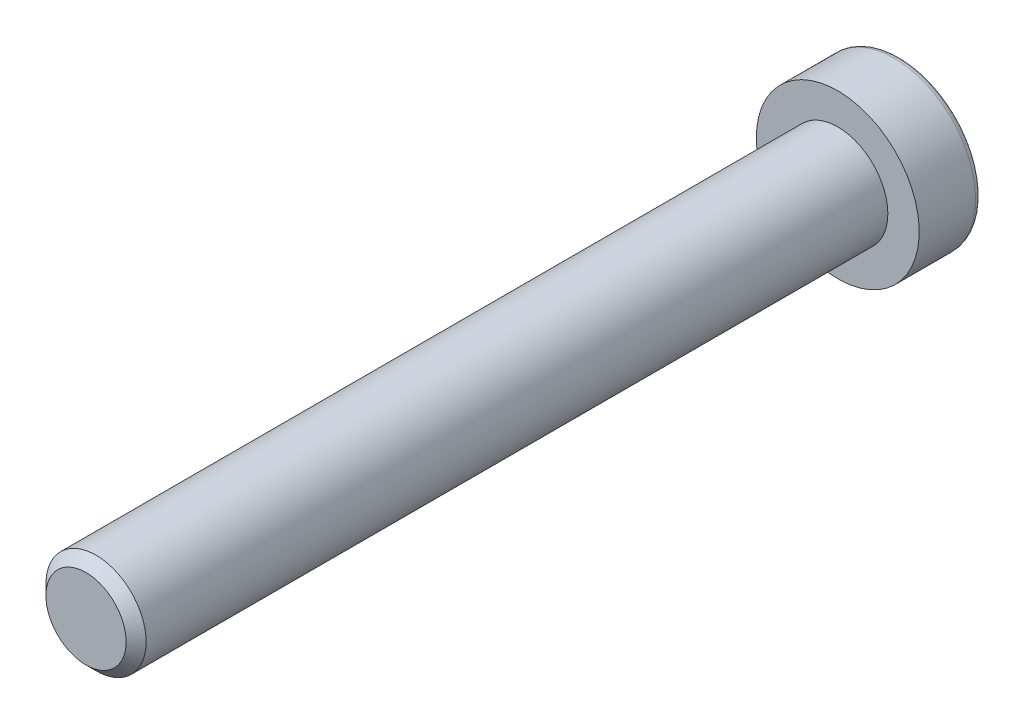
ISO-10303-21;
HEADER;
FILE_DESCRIPTION(('STEP AP214'),'2;1');
FILE_NAME('part.step','',(''),(''),'','','');
FILE_SCHEMA(('AUTOMOTIVE_DESIGN { 1 0 10303 214 1 1 1 1 }'));
ENDSEC;
DATA;
#1=APPLICATION_CONTEXT('core data for automotive mechanical design processes');
#2=APPLICATION_PROTOCOL_DEFINITION('international standard','automotive_design',2000,#1);
#3=PRODUCT_CONTEXT('',#1,'mechanical');
#4=PRODUCT('Part','Part','',(#3));
#5=PRODUCT_RELATED_PRODUCT_CATEGORY('part','',(#4));
#6=PRODUCT_DEFINITION_FORMATION('','',#4);
#7=PRODUCT_DEFINITION_CONTEXT('part definition',#1,'design');
#8=PRODUCT_DEFINITION('design','',#6,#7);
#9=PRODUCT_DEFINITION_SHAPE('','',#8);
#10=(LENGTH_UNIT() NAMED_UNIT(*) SI_UNIT(.MILLI.,.METRE.));
#11=(NAMED_UNIT(*) PLANE_ANGLE_UNIT() SI_UNIT($,.RADIAN.));
#12=(NAMED_UNIT(*) SI_UNIT($,.STERADIAN.) SOLID_ANGLE_UNIT());
#13=UNCERTAINTY_MEASURE_WITH_UNIT(LENGTH_MEASURE(1.E-05),#10,'distance_accuracy_value','');
#14=(GEOMETRIC_REPRESENTATION_CONTEXT(3) GLOBAL_UNCERTAINTY_ASSIGNED_CONTEXT((#13)) GLOBAL_UNIT_ASSIGNED_CONTEXT((#10,
#11,#12)) REPRESENTATION_CONTEXT('',''));
#15=CARTESIAN_POINT('',(0.,0.,0.));
#16=DIRECTION('',(0.,0.,1.));
#17=DIRECTION('',(1.,0.,0.));
#18=AXIS2_PLACEMENT_3D('',#15,#16,#17);
#19=CARTESIAN_POINT('',(0.,0.,-5.));
#20=DIRECTION('',(0.,0.,1.));
#21=DIRECTION('',(1.,0.,0.));
#22=AXIS2_PLACEMENT_3D('',#19,#20,#21);
#23=PLANE('',#22);
#24=CARTESIAN_POINT('',(0.,0.,-5.));
#25=DIRECTION('',(0.,0.,-1.));
#26=DIRECTION('',(-1.,0.,0.));
#27=AXIS2_PLACEMENT_3D('',#24,#25,#26);
#28=CIRCLE('',#27,6.);
#29=CARTESIAN_POINT('',(-6.,0.,-5.));
#30=VERTEX_POINT('',#29);
#31=EDGE_CURVE('E139',#30,#30,#28,.T.);
#32=ORIENTED_EDGE('',*,*,#31,.T.);
#33=EDGE_LOOP('',(#32));
#34=FACE_BOUND('',#33,.T.);
#35=DIRECTION('',(-0.866025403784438,-0.500000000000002,0.));
#36=VECTOR('',#35,1.);
#37=CARTESIAN_POINT('',(0.,3.46410161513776,-5.));
#38=LINE('',#37,#36);
#39=CARTESIAN_POINT('',(0.,3.46410161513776,-5.));
#40=VERTEX_POINT('',#39);
#41=CARTESIAN_POINT('',(-3.,1.73205080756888,-5.));
#42=VERTEX_POINT('',#41);
#43=EDGE_CURVE('E83',#40,#42,#38,.T.);
#44=ORIENTED_EDGE('',*,*,#43,.T.);
#45=DIRECTION('',(0.,-1.,0.));
#46=VECTOR('',#45,1.);
#47=CARTESIAN_POINT('',(-3.,-1.73205080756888,-5.));
#48=LINE('',#47,#46);
#49=CARTESIAN_POINT('',(-3.,-1.73205080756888,-5.));
#50=VERTEX_POINT('',#49);
#51=EDGE_CURVE('E91',#42,#50,#48,.T.);
#52=ORIENTED_EDGE('',*,*,#51,.T.);
#53=DIRECTION('',(0.866025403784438,-0.500000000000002,0.));
#54=VECTOR('',#53,1.);
#55=CARTESIAN_POINT('',(0.,-3.46410161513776,-5.));
#56=LINE('',#55,#54);
#57=CARTESIAN_POINT('',(0.,-3.46410161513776,-5.));
#58=VERTEX_POINT('',#57);
#59=EDGE_CURVE('E109',#50,#58,#56,.T.);
#60=ORIENTED_EDGE('',*,*,#59,.T.);
#61=DIRECTION('',(0.86602540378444,0.499999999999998,0.));
#62=VECTOR('',#61,1.);
#63=CARTESIAN_POINT('',(0.,-3.46410161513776,-5.));
#64=LINE('',#63,#62);
#65=CARTESIAN_POINT('',(3.,-1.73205080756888,-5.));
#66=VERTEX_POINT('',#65);
#67=EDGE_CURVE('E112',#58,#66,#64,.T.);
#68=ORIENTED_EDGE('',*,*,#67,.T.);
#69=DIRECTION('',(0.,1.,0.));
#70=VECTOR('',#69,1.);
#71=CARTESIAN_POINT('',(3.,-1.73205080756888,-5.));
#72=LINE('',#71,#70);
#73=CARTESIAN_POINT('',(3.,1.73205080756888,-5.));
#74=VERTEX_POINT('',#73);
#75=EDGE_CURVE('E102',#66,#74,#72,.T.);
#76=ORIENTED_EDGE('',*,*,#75,.T.);
#77=DIRECTION('',(-0.86602540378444,0.499999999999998,0.));
#78=VECTOR('',#77,1.);
#79=CARTESIAN_POINT('',(0.,3.46410161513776,-5.));
#80=LINE('',#79,#78);
#81=EDGE_CURVE('E43',#74,#40,#80,.T.);
#82=ORIENTED_EDGE('',*,*,#81,.T.);
#83=EDGE_LOOP('',(#44,#52,#60,#68,#76,#82));
#84=FACE_BOUND('',#83,.T.);
#85=ADVANCED_FACE('F29',(#34,#84),#23,.F.);
#86=CARTESIAN_POINT('',(0.,0.,-4.5));
#87=DIRECTION('',(0.,0.,-1.));
#88=DIRECTION('',(-1.,0.,0.));
#89=AXIS2_PLACEMENT_3D('',#86,#87,#88);
#90=TOROIDAL_SURFACE('',#89,6.,0.499999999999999);
#91=ORIENTED_EDGE('',*,*,#31,.F.);
#92=EDGE_LOOP('',(#91));
#93=FACE_BOUND('',#92,.T.);
#94=CARTESIAN_POINT('',(0.,0.,-4.5));
#95=DIRECTION('',(0.,0.,-1.));
#96=DIRECTION('',(-1.,0.,0.));
#97=AXIS2_PLACEMENT_3D('',#94,#95,#96);
#98=CIRCLE('',#97,6.5);
#99=CARTESIAN_POINT('',(-6.5,0.,-4.5));
#100=VERTEX_POINT('',#99);
#101=EDGE_CURVE('E136',#100,#100,#98,.T.);
#102=ORIENTED_EDGE('',*,*,#101,.T.);
#103=EDGE_LOOP('',(#102));
#104=FACE_BOUND('',#103,.T.);
#105=ADVANCED_FACE('F158',(#93,#104),#90,.T.);
#106=CARTESIAN_POINT('',(0.,0.,0.));
#107=DIRECTION('',(0.,0.,-1.));
#108=DIRECTION('',(-1.,0.,0.));
#109=AXIS2_PLACEMENT_3D('',#106,#107,#108);
#110=CYLINDRICAL_SURFACE('',#109,6.5);
#111=ORIENTED_EDGE('',*,*,#101,.F.);
#112=EDGE_LOOP('',(#111));
#113=FACE_BOUND('',#112,.T.);
#114=CARTESIAN_POINT('',(0.,0.,0.));
#115=DIRECTION('',(0.,0.,-1.));
#116=DIRECTION('',(-1.,0.,0.));
#117=AXIS2_PLACEMENT_3D('',#114,#115,#116);
#118=CIRCLE('',#117,6.5);
#119=CARTESIAN_POINT('',(-6.5,0.,0.));
#120=VERTEX_POINT('',#119);
#121=EDGE_CURVE('E97',#120,#120,#118,.T.);
#122=ORIENTED_EDGE('',*,*,#121,.T.);
#123=EDGE_LOOP('',(#122));
#124=FACE_BOUND('',#123,.T.);
#125=ADVANCED_FACE('F163',(#113,#124),#110,.T.);
#126=CARTESIAN_POINT('',(0.,0.,0.));
#127=DIRECTION('',(0.,0.,-1.));
#128=DIRECTION('',(-1.,0.,0.));
#129=AXIS2_PLACEMENT_3D('',#126,#127,#128);
#130=PLANE('',#129);
#131=CARTESIAN_POINT('',(0.,0.,0.));
#132=DIRECTION('',(0.,0.,1.));
#133=DIRECTION('',(1.,0.,0.));
#134=AXIS2_PLACEMENT_3D('',#131,#132,#133);
#135=CIRCLE('',#134,4.);
#136=CARTESIAN_POINT('',(4.,0.,0.));
#137=VERTEX_POINT('',#136);
#138=EDGE_CURVE('E103',#137,#137,#135,.T.);
#139=ORIENTED_EDGE('',*,*,#138,.F.);
#140=EDGE_LOOP('',(#139));
#141=FACE_BOUND('',#140,.T.);
#142=ORIENTED_EDGE('',*,*,#121,.F.);
#143=EDGE_LOOP('',(#142));
#144=FACE_BOUND('',#143,.T.);
#145=ADVANCED_FACE('F171',(#141,#144),#130,.F.);
#146=CARTESIAN_POINT('',(0.,3.46410161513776,-0.999999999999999));
#147=DIRECTION('',(-0.499999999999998,-0.86602540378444,0.));
#148=DIRECTION('',(0.86602540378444,-0.499999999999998,0.));
#149=AXIS2_PLACEMENT_3D('',#146,#147,#148);
#150=PLANE('',#149);
#151=ORIENTED_EDGE('',*,*,#81,.F.);
#152=DIRECTION('',(0.,0.,-1.));
#153=VECTOR('',#152,1.);
#154=CARTESIAN_POINT('',(3.,1.73205080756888,-0.999999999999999));
#155=LINE('',#154,#153);
#156=CARTESIAN_POINT('',(3.,1.73205080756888,-0.999999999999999));
#157=VERTEX_POINT('',#156);
#158=EDGE_CURVE('E125',#157,#74,#155,.T.);
#159=ORIENTED_EDGE('',*,*,#158,.F.);
#160=DIRECTION('',(-0.86602540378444,0.499999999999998,0.));
#161=VECTOR('',#160,1.);
#162=CARTESIAN_POINT('',(0.,3.46410161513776,-0.999999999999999));
#163=LINE('',#162,#161);
#164=CARTESIAN_POINT('',(0.,3.46410161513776,-0.999999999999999));
#165=VERTEX_POINT('',#164);
#166=EDGE_CURVE('E96',#157,#165,#163,.T.);
#167=ORIENTED_EDGE('',*,*,#166,.T.);
#168=DIRECTION('',(0.,0.,-1.));
#169=VECTOR('',#168,1.);
#170=CARTESIAN_POINT('',(0.,3.46410161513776,-0.999999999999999));
#171=LINE('',#170,#169);
#172=EDGE_CURVE('E85',#165,#40,#171,.T.);
#173=ORIENTED_EDGE('',*,*,#172,.T.);
#174=EDGE_LOOP('',(#151,#159,#167,#173));
#175=FACE_BOUND('',#174,.T.);
#176=ADVANCED_FACE('F94',(#175),#150,.T.);
#177=CARTESIAN_POINT('',(0.,3.46410161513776,-0.999999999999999));
#178=DIRECTION('',(0.500000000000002,-0.866025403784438,0.));
#179=DIRECTION('',(0.866025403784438,0.500000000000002,0.));
#180=AXIS2_PLACEMENT_3D('',#177,#178,#179);
#181=PLANE('',#180);
#182=ORIENTED_EDGE('',*,*,#43,.F.);
#183=ORIENTED_EDGE('',*,*,#172,.F.);
#184=DIRECTION('',(-0.866025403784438,-0.500000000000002,0.));
#185=VECTOR('',#184,1.);
#186=CARTESIAN_POINT('',(0.,3.46410161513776,-0.999999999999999));
#187=LINE('',#186,#185);
#188=CARTESIAN_POINT('',(-3.,1.73205080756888,-0.999999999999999));
#189=VERTEX_POINT('',#188);
#190=EDGE_CURVE('E116',#165,#189,#187,.T.);
#191=ORIENTED_EDGE('',*,*,#190,.T.);
#192=DIRECTION('',(0.,0.,-1.));
#193=VECTOR('',#192,1.);
#194=CARTESIAN_POINT('',(-3.,1.73205080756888,-0.999999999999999));
#195=LINE('',#194,#193);
#196=EDGE_CURVE('E87',#189,#42,#195,.T.);
#197=ORIENTED_EDGE('',*,*,#196,.T.);
#198=EDGE_LOOP('',(#182,#183,#191,#197));
#199=FACE_BOUND('',#198,.T.);
#200=ADVANCED_FACE('F84',(#199),#181,.T.);
#201=CARTESIAN_POINT('',(-3.,-1.73205080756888,-0.999999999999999));
#202=DIRECTION('',(1.,0.,0.));
#203=DIRECTION('',(0.,0.,-1.));
#204=AXIS2_PLACEMENT_3D('',#201,#202,#203);
#205=PLANE('',#204);
#206=ORIENTED_EDGE('',*,*,#51,.F.);
#207=ORIENTED_EDGE('',*,*,#196,.F.);
#208=DIRECTION('',(0.,-1.,0.));
#209=VECTOR('',#208,1.);
#210=CARTESIAN_POINT('',(-3.,-1.73205080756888,-0.999999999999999));
#211=LINE('',#210,#209);
#212=CARTESIAN_POINT('',(-3.,-1.73205080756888,-0.999999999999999));
#213=VERTEX_POINT('',#212);
#214=EDGE_CURVE('E118',#189,#213,#211,.T.);
#215=ORIENTED_EDGE('',*,*,#214,.T.);
#216=DIRECTION('',(0.,0.,-1.));
#217=VECTOR('',#216,1.);
#218=CARTESIAN_POINT('',(-3.,-1.73205080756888,-0.999999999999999));
#219=LINE('',#218,#217);
#220=EDGE_CURVE('E131',#213,#50,#219,.T.);
#221=ORIENTED_EDGE('',*,*,#220,.T.);
#222=EDGE_LOOP('',(#206,#207,#215,#221));
#223=FACE_BOUND('',#222,.T.);
#224=ADVANCED_FACE('F186',(#223),#205,.T.);
#225=CARTESIAN_POINT('',(0.,-3.46410161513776,-0.999999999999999));
#226=DIRECTION('',(0.500000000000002,0.866025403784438,0.));
#227=DIRECTION('',(-0.866025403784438,0.500000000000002,0.));
#228=AXIS2_PLACEMENT_3D('',#225,#226,#227);
#229=PLANE('',#228);
#230=ORIENTED_EDGE('',*,*,#59,.F.);
#231=ORIENTED_EDGE('',*,*,#220,.F.);
#232=DIRECTION('',(0.866025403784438,-0.500000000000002,0.));
#233=VECTOR('',#232,1.);
#234=CARTESIAN_POINT('',(0.,-3.46410161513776,-0.999999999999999));
#235=LINE('',#234,#233);
#236=CARTESIAN_POINT('',(0.,-3.46410161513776,-0.999999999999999));
#237=VERTEX_POINT('',#236);
#238=EDGE_CURVE('E120',#213,#237,#235,.T.);
#239=ORIENTED_EDGE('',*,*,#238,.T.);
#240=DIRECTION('',(0.,0.,-1.));
#241=VECTOR('',#240,1.);
#242=CARTESIAN_POINT('',(0.,-3.46410161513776,-0.999999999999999));
#243=LINE('',#242,#241);
#244=EDGE_CURVE('E129',#237,#58,#243,.T.);
#245=ORIENTED_EDGE('',*,*,#244,.T.);
#246=EDGE_LOOP('',(#230,#231,#239,#245));
#247=FACE_BOUND('',#246,.T.);
#248=ADVANCED_FACE('F189',(#247),#229,.T.);
#249=CARTESIAN_POINT('',(0.,-3.46410161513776,-0.999999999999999));
#250=DIRECTION('',(-0.499999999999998,0.86602540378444,0.));
#251=DIRECTION('',(-0.86602540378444,-0.499999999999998,0.));
#252=AXIS2_PLACEMENT_3D('',#249,#250,#251);
#253=PLANE('',#252);
#254=ORIENTED_EDGE('',*,*,#67,.F.);
#255=ORIENTED_EDGE('',*,*,#244,.F.);
#256=DIRECTION('',(0.86602540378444,0.499999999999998,0.));
#257=VECTOR('',#256,1.);
#258=CARTESIAN_POINT('',(0.,-3.46410161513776,-0.999999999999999));
#259=LINE('',#258,#257);
#260=CARTESIAN_POINT('',(3.,-1.73205080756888,-0.999999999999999));
#261=VERTEX_POINT('',#260);
#262=EDGE_CURVE('E122',#237,#261,#259,.T.);
#263=ORIENTED_EDGE('',*,*,#262,.T.);
#264=DIRECTION('',(0.,0.,-1.));
#265=VECTOR('',#264,1.);
#266=CARTESIAN_POINT('',(3.,-1.73205080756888,-0.999999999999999));
#267=LINE('',#266,#265);
#268=EDGE_CURVE('E127',#261,#66,#267,.T.);
#269=ORIENTED_EDGE('',*,*,#268,.T.);
#270=EDGE_LOOP('',(#254,#255,#263,#269));
#271=FACE_BOUND('',#270,.T.);
#272=ADVANCED_FACE('F193',(#271),#253,.T.);
#273=CARTESIAN_POINT('',(3.,-1.73205080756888,-0.999999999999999));
#274=DIRECTION('',(-1.,0.,0.));
#275=DIRECTION('',(0.,-1.,0.));
#276=AXIS2_PLACEMENT_3D('',#273,#274,#275);
#277=PLANE('',#276);
#278=ORIENTED_EDGE('',*,*,#75,.F.);
#279=ORIENTED_EDGE('',*,*,#268,.F.);
#280=DIRECTION('',(0.,1.,0.));
#281=VECTOR('',#280,1.);
#282=CARTESIAN_POINT('',(3.,-1.73205080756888,-0.999999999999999));
#283=LINE('',#282,#281);
#284=EDGE_CURVE('E50',#261,#157,#283,.T.);
#285=ORIENTED_EDGE('',*,*,#284,.T.);
#286=ORIENTED_EDGE('',*,*,#158,.T.);
#287=EDGE_LOOP('',(#278,#279,#285,#286));
#288=FACE_BOUND('',#287,.T.);
#289=ADVANCED_FACE('F197',(#288),#277,.T.);
#290=CARTESIAN_POINT('',(-3.,5.19615242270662,-0.999999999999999));
#291=DIRECTION('',(0.,0.,1.));
#292=DIRECTION('',(1.,0.,0.));
#293=AXIS2_PLACEMENT_3D('',#290,#291,#292);
#294=PLANE('',#293);
#295=ORIENTED_EDGE('',*,*,#166,.F.);
#296=ORIENTED_EDGE('',*,*,#284,.F.);
#297=ORIENTED_EDGE('',*,*,#262,.F.);
#298=ORIENTED_EDGE('',*,*,#238,.F.);
#299=ORIENTED_EDGE('',*,*,#214,.F.);
#300=ORIENTED_EDGE('',*,*,#190,.F.);
#301=EDGE_LOOP('',(#295,#296,#297,#298,#299,#300));
#302=FACE_BOUND('',#301,.T.);
#303=ADVANCED_FACE('F201',(#302),#294,.F.);
#304=CARTESIAN_POINT('',(0.,0.,60.));
#305=DIRECTION('',(0.,0.,1.));
#306=DIRECTION('',(1.,0.,0.));
#307=AXIS2_PLACEMENT_3D('',#304,#305,#306);
#308=PLANE('',#307);
#309=CARTESIAN_POINT('',(0.,0.,60.));
#310=DIRECTION('',(0.,0.,1.));
#311=DIRECTION('',(1.,0.,0.));
#312=AXIS2_PLACEMENT_3D('',#309,#310,#311);
#313=CIRCLE('',#312,3.2);
#314=CARTESIAN_POINT('',(3.20000000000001,0.,60.));
#315=VERTEX_POINT('',#314);
#316=EDGE_CURVE('E36',#315,#315,#313,.T.);
#317=ORIENTED_EDGE('',*,*,#316,.T.);
#318=EDGE_LOOP('',(#317));
#319=FACE_BOUND('',#318,.T.);
#320=ADVANCED_FACE('F144',(#319),#308,.T.);
#321=CARTESIAN_POINT('',(0.,0.,0.));
#322=DIRECTION('',(0.,0.,1.));
#323=DIRECTION('',(1.,0.,0.));
#324=AXIS2_PLACEMENT_3D('',#321,#322,#323);
#325=CYLINDRICAL_SURFACE('',#324,4.);
#326=CARTESIAN_POINT('',(0.,0.,59.2));
#327=DIRECTION('',(0.,0.,1.));
#328=DIRECTION('',(1.,0.,0.));
#329=AXIS2_PLACEMENT_3D('',#326,#327,#328);
#330=CIRCLE('',#329,4.);
#331=CARTESIAN_POINT('',(4.00000000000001,0.,59.2));
#332=VERTEX_POINT('',#331);
#333=EDGE_CURVE('E11',#332,#332,#330,.F.);
#334=ORIENTED_EDGE('',*,*,#333,.T.);
#335=EDGE_LOOP('',(#334));
#336=FACE_BOUND('',#335,.T.);
#337=ORIENTED_EDGE('',*,*,#138,.T.);
#338=EDGE_LOOP('',(#337));
#339=FACE_BOUND('',#338,.T.);
#340=ADVANCED_FACE('F148',(#336,#339),#325,.T.);
#341=CARTESIAN_POINT('',(0.,0.,60.));
#342=DIRECTION('',(0.,0.,-1.));
#343=DIRECTION('',(-1.,0.,0.));
#344=AXIS2_PLACEMENT_3D('',#341,#342,#343);
#345=CONICAL_SURFACE('',#344,3.2,0.785398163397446);
#346=ORIENTED_EDGE('',*,*,#333,.F.);
#347=EDGE_LOOP('',(#346));
#348=FACE_BOUND('',#347,.T.);
#349=ORIENTED_EDGE('',*,*,#316,.F.);
#350=EDGE_LOOP('',(#349));
#351=FACE_BOUND('',#350,.T.);
#352=ADVANCED_FACE('F146',(#348,#351),#345,.T.);
#353=CLOSED_SHELL('',(#85,#105,#125,#145,#176,#200,#224,#248,#272,#289,#303,#320,#340,#352));
#354=MANIFOLD_SOLID_BREP('B2',#353);
#355=ADVANCED_BREP_SHAPE_REPRESENTATION('',(#18,#354),#14);
#356=SHAPE_DEFINITION_REPRESENTATION(#9,#355);
ENDSEC;
END-ISO-10303-21;
